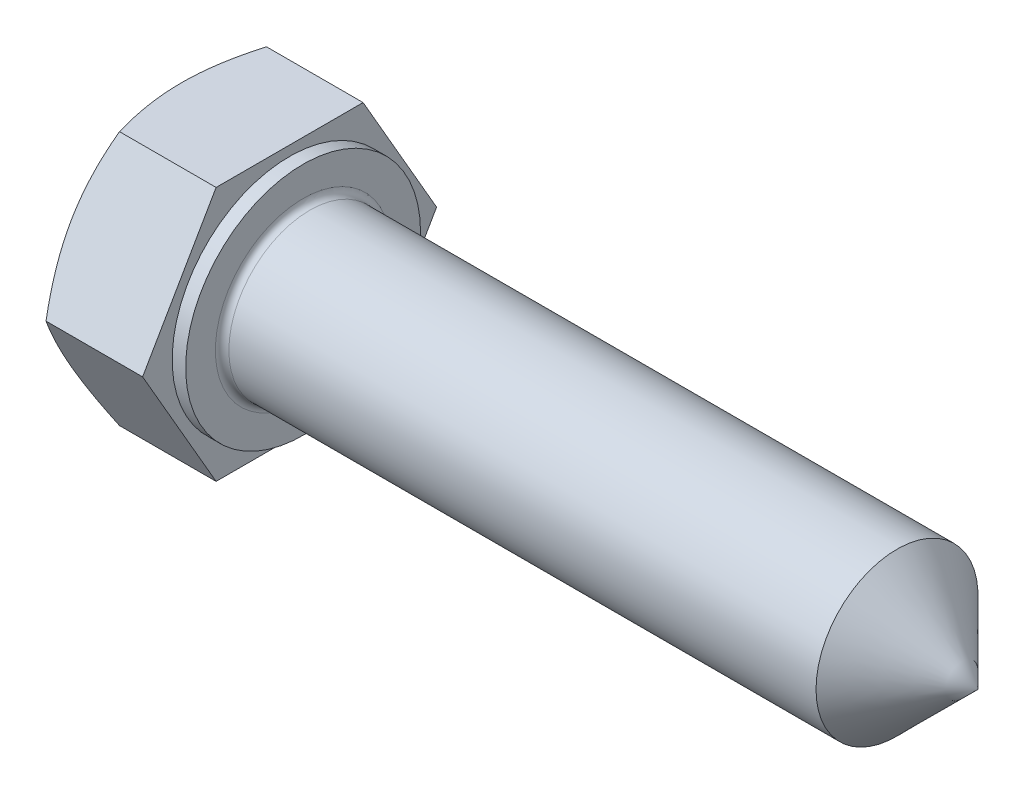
from build123d import *

# Parameters (mm, degrees)
BASEHEAD_DEPTH = 4
SKETCH2_R      = 4.35
NECK_DEPTH     = 0.5
SKETCH1_R      = 3
BASEBODY_DEPTH = 25
FILLET1_R      = 0.25


with BuildPart() as part:
    # Sketch3 → BaseHead (new body)
    with BuildSketch(Plane(origin=(0, 0, 0), x_dir=(0, 0, -1), z_dir=(1, 0, 0))):
        Polygon((-5.445, 0), (-2.7225, -4.715508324), (2.7225, -4.715508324), (5.445, 0), (2.7225, 4.715508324), (-2.7225, 4.715508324), align=None)
    extrude(amount=BASEHEAD_DEPTH)

    # Sketch2 → Neck (add)
    with BuildSketch(Plane(origin=(4, -1.739290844, 0.869299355), x_dir=(0, 0, -1), z_dir=(1, 0, 0))):
        with Locations((0.869299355, 1.739290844)):
            Circle(SKETCH2_R)
    extrude(amount=NECK_DEPTH)

    # Sketch1 → BaseBody (add)
    with BuildSketch(Plane(origin=(4.5, -1.883204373, 0.262725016), x_dir=(0, 0, -1), z_dir=(1, 0, 0))):
        with Locations((0.262725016, 1.883204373)):
            Circle(SKETCH1_R)
    extrude(amount=BASEBODY_DEPTH)

    # Sketch4 → Cut-Revolve1 (revolve, cut)
    with BuildSketch(Plane(origin=(6.906383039, 0, -1.461383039), x_dir=(0, 0, -1), z_dir=(0, 1, 0))):
        Polygon((3.983616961, 6.906383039), (3.983616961, 6.485210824), (3.254125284, 6.906383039), align=None)
    revolve(axis=Axis((7.793963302, 0, 0), (-1, 0, 0)), mode=Mode.SUBTRACT)

    # Sketch6 → Cut-Revolve2 (revolve, cut)
    with BuildSketch(Plane(origin=(-10.579812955, 0, 31.579812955), x_dir=(0, 0, -1), z_dir=(0, 1, 0)), mode=Mode.PRIVATE) as cut_revolve2_sk:
        Polygon((31.579812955, -43.014603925), (52.579812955, -43.014603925), (52.579812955, -19.079812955), (31.579812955, -40.079812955), align=None)
    revolve(cut_revolve2_sk.sketch.rotate(Axis((-9.009671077, 0, 0), (1, 0, 0)), 180), axis=Axis((-9.009671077, 0, 0), (1, 0, 0)), mode=Mode.SUBTRACT)

    # Fillet1
    fillet1_edges = [part.edges().sort_by_distance(p)[0] for p in [
        (4.5, 0, 3),
    ]]
    fillet(fillet1_edges, radius=FILLET1_R)


solid = part.part
